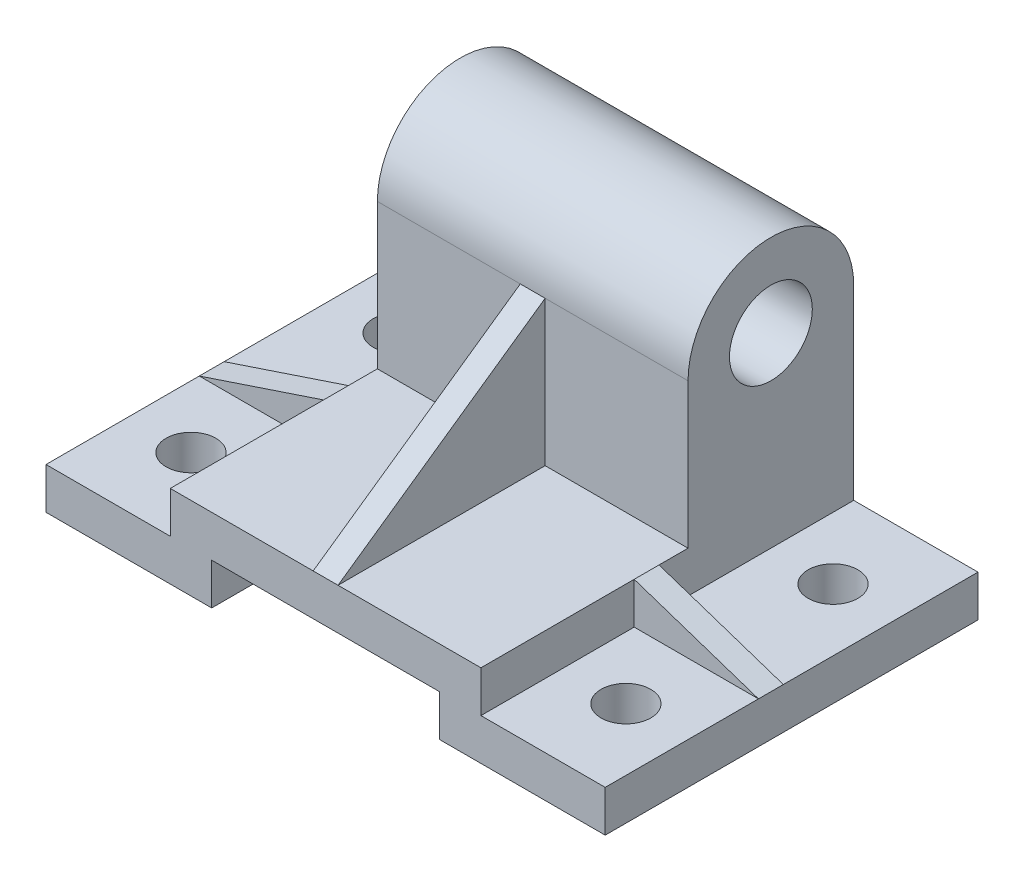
ISO-10303-21;
HEADER;
FILE_DESCRIPTION(('STEP AP214'),'2;1');
FILE_NAME('part.step','',(''),(''),'','','');
FILE_SCHEMA(('AUTOMOTIVE_DESIGN { 1 0 10303 214 1 1 1 1 }'));
ENDSEC;
DATA;
#1=APPLICATION_CONTEXT('core data for automotive mechanical design processes');
#2=APPLICATION_PROTOCOL_DEFINITION('international standard','automotive_design',2000,#1);
#3=PRODUCT_CONTEXT('',#1,'mechanical');
#4=PRODUCT('Part','Part','',(#3));
#5=PRODUCT_RELATED_PRODUCT_CATEGORY('part','',(#4));
#6=PRODUCT_DEFINITION_FORMATION('','',#4);
#7=PRODUCT_DEFINITION_CONTEXT('part definition',#1,'design');
#8=PRODUCT_DEFINITION('design','',#6,#7);
#9=PRODUCT_DEFINITION_SHAPE('','',#8);
#10=(LENGTH_UNIT() NAMED_UNIT(*) SI_UNIT(.MILLI.,.METRE.));
#11=(NAMED_UNIT(*) PLANE_ANGLE_UNIT() SI_UNIT($,.RADIAN.));
#12=(NAMED_UNIT(*) SI_UNIT($,.STERADIAN.) SOLID_ANGLE_UNIT());
#13=UNCERTAINTY_MEASURE_WITH_UNIT(LENGTH_MEASURE(1.E-05),#10,'distance_accuracy_value','');
#14=(GEOMETRIC_REPRESENTATION_CONTEXT(3) GLOBAL_UNCERTAINTY_ASSIGNED_CONTEXT((#13)) GLOBAL_UNIT_ASSIGNED_CONTEXT((#10,
#11,#12)) REPRESENTATION_CONTEXT('',''));
#15=CARTESIAN_POINT('',(0.,0.,0.));
#16=DIRECTION('',(0.,0.,1.));
#17=DIRECTION('',(1.,0.,0.));
#18=AXIS2_PLACEMENT_3D('',#15,#16,#17);
#19=CARTESIAN_POINT('',(105.,20.,-90.));
#20=DIRECTION('',(0.,1.,0.));
#21=DIRECTION('',(-1.,0.,0.));
#22=AXIS2_PLACEMENT_3D('',#19,#20,#21);
#23=PLANE('',#22);
#24=DIRECTION('',(1.,0.,0.));
#25=VECTOR('',#24,1.);
#26=CARTESIAN_POINT('',(105.,20.,-50.));
#27=LINE('',#26,#25);
#28=CARTESIAN_POINT('',(70.5,20.,-50.));
#29=VERTEX_POINT('',#28);
#30=CARTESIAN_POINT('',(105.,20.,-50.));
#31=VERTEX_POINT('',#30);
#32=EDGE_CURVE('E218',#29,#31,#27,.T.);
#33=ORIENTED_EDGE('',*,*,#32,.F.);
#34=DIRECTION('',(0.,0.,1.));
#35=VECTOR('',#34,1.);
#36=CARTESIAN_POINT('',(70.5,20.,-50.));
#37=LINE('',#36,#35);
#38=CARTESIAN_POINT('',(70.5,20.,0.));
#39=VERTEX_POINT('',#38);
#40=EDGE_CURVE('E50',#29,#39,#37,.T.);
#41=ORIENTED_EDGE('',*,*,#40,.T.);
#42=DIRECTION('',(-1.,0.,0.));
#43=VECTOR('',#42,1.);
#44=CARTESIAN_POINT('',(105.,20.,0.));
#45=LINE('',#44,#43);
#46=CARTESIAN_POINT('',(105.,20.,0.));
#47=VERTEX_POINT('',#46);
#48=EDGE_CURVE('E306',#47,#39,#45,.T.);
#49=ORIENTED_EDGE('',*,*,#48,.F.);
#50=DIRECTION('',(0.,0.,1.));
#51=VECTOR('',#50,1.);
#52=CARTESIAN_POINT('',(105.,20.,-90.));
#53=LINE('',#52,#51);
#54=CARTESIAN_POINT('',(105.,20.,-37.));
#55=VERTEX_POINT('',#54);
#56=EDGE_CURVE('E330',#55,#47,#53,.T.);
#57=ORIENTED_EDGE('',*,*,#56,.F.);
#58=DIRECTION('',(0.,0.,1.));
#59=VECTOR('',#58,1.);
#60=CARTESIAN_POINT('',(105.,20.,-43.));
#61=LINE('',#60,#59);
#62=CARTESIAN_POINT('',(105.,20.,-43.));
#63=VERTEX_POINT('',#62);
#64=EDGE_CURVE('E418',#63,#55,#61,.T.);
#65=ORIENTED_EDGE('',*,*,#64,.F.);
#66=EDGE_CURVE('E327',#31,#63,#53,.T.);
#67=ORIENTED_EDGE('',*,*,#66,.F.);
#68=EDGE_LOOP('',(#33,#41,#49,#57,#65,#67));
#69=FACE_BOUND('',#68,.T.);
#70=ADVANCED_FACE('F33',(#69),#23,.T.);
#71=CARTESIAN_POINT('',(105.,55.,-50.));
#72=DIRECTION('',(0.,0.,1.));
#73=DIRECTION('',(0.,-1.,0.));
#74=AXIS2_PLACEMENT_3D('',#71,#72,#73);
#75=PLANE('',#74);
#76=DIRECTION('',(-1.,0.,0.));
#77=VECTOR('',#76,1.);
#78=CARTESIAN_POINT('',(105.,55.,-50.));
#79=LINE('',#78,#77);
#80=CARTESIAN_POINT('',(105.,55.,-50.));
#81=VERTEX_POINT('',#80);
#82=CARTESIAN_POINT('',(70.5,55.,-50.));
#83=VERTEX_POINT('',#82);
#84=EDGE_CURVE('E226',#81,#83,#79,.T.);
#85=ORIENTED_EDGE('',*,*,#84,.T.);
#86=DIRECTION('',(0.,-1.,0.));
#87=VECTOR('',#86,1.);
#88=CARTESIAN_POINT('',(70.5,55.,-50.));
#89=LINE('',#88,#87);
#90=EDGE_CURVE('E656',#83,#29,#89,.T.);
#91=ORIENTED_EDGE('',*,*,#90,.T.);
#92=ORIENTED_EDGE('',*,*,#32,.T.);
#93=DIRECTION('',(0.,1.,0.));
#94=VECTOR('',#93,1.);
#95=CARTESIAN_POINT('',(105.,55.,-50.));
#96=LINE('',#95,#94);
#97=EDGE_CURVE('E445',#31,#81,#96,.T.);
#98=ORIENTED_EDGE('',*,*,#97,.T.);
#99=EDGE_LOOP('',(#85,#91,#92,#98));
#100=FACE_BOUND('',#99,.T.);
#101=ADVANCED_FACE('F474',(#100),#75,.T.);
#102=CARTESIAN_POINT('',(105.,10.,-90.));
#103=DIRECTION('',(1.,0.,0.));
#104=DIRECTION('',(0.,0.,-1.));
#105=AXIS2_PLACEMENT_3D('',#102,#103,#104);
#106=PLANE('',#105);
#107=DIRECTION('',(0.,0.,1.));
#108=VECTOR('',#107,1.);
#109=CARTESIAN_POINT('',(105.,10.,-90.));
#110=LINE('',#109,#108);
#111=CARTESIAN_POINT('',(105.,10.,-37.));
#112=VERTEX_POINT('',#111);
#113=CARTESIAN_POINT('',(105.,10.,0.));
#114=VERTEX_POINT('',#113);
#115=EDGE_CURVE('E334',#112,#114,#110,.T.);
#116=ORIENTED_EDGE('',*,*,#115,.F.);
#117=DIRECTION('',(0.,-1.,0.));
#118=VECTOR('',#117,1.);
#119=CARTESIAN_POINT('',(105.,10.,-37.));
#120=LINE('',#119,#118);
#121=EDGE_CURVE('E393',#55,#112,#120,.T.);
#122=ORIENTED_EDGE('',*,*,#121,.F.);
#123=ORIENTED_EDGE('',*,*,#56,.T.);
#124=DIRECTION('',(0.,1.,0.));
#125=VECTOR('',#124,1.);
#126=CARTESIAN_POINT('',(105.,10.,0.));
#127=LINE('',#126,#125);
#128=EDGE_CURVE('E303',#114,#47,#127,.T.);
#129=ORIENTED_EDGE('',*,*,#128,.F.);
#130=EDGE_LOOP('',(#116,#122,#123,#129));
#131=FACE_BOUND('',#130,.T.);
#132=ADVANCED_FACE('F390',(#131),#106,.T.);
#133=CARTESIAN_POINT('',(135.,10.,-90.));
#134=DIRECTION('',(0.,1.,0.));
#135=DIRECTION('',(0.,0.,1.));
#136=AXIS2_PLACEMENT_3D('',#133,#134,#135);
#137=PLANE('',#136);
#138=CARTESIAN_POINT('',(120.,10.,-20.));
#139=DIRECTION('',(0.,1.,0.));
#140=DIRECTION('',(0.,0.,-1.));
#141=AXIS2_PLACEMENT_3D('',#138,#139,#140);
#142=CIRCLE('',#141,5.99999999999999);
#143=CARTESIAN_POINT('',(120.,10.,-26.));
#144=VERTEX_POINT('',#143);
#145=EDGE_CURVE('E234',#144,#144,#142,.T.);
#146=ORIENTED_EDGE('',*,*,#145,.F.);
#147=EDGE_LOOP('',(#146));
#148=FACE_BOUND('',#147,.T.);
#149=DIRECTION('',(0.,0.,1.));
#150=VECTOR('',#149,1.);
#151=CARTESIAN_POINT('',(135.,10.,-90.));
#152=LINE('',#151,#150);
#153=CARTESIAN_POINT('',(135.,10.,-37.));
#154=VERTEX_POINT('',#153);
#155=CARTESIAN_POINT('',(135.,10.,0.));
#156=VERTEX_POINT('',#155);
#157=EDGE_CURVE('E338',#154,#156,#152,.T.);
#158=ORIENTED_EDGE('',*,*,#157,.F.);
#159=DIRECTION('',(1.,0.,0.));
#160=VECTOR('',#159,1.);
#161=CARTESIAN_POINT('',(135.,10.,-37.));
#162=LINE('',#161,#160);
#163=EDGE_CURVE('E58',#112,#154,#162,.T.);
#164=ORIENTED_EDGE('',*,*,#163,.F.);
#165=ORIENTED_EDGE('',*,*,#115,.T.);
#166=DIRECTION('',(-1.,0.,0.));
#167=VECTOR('',#166,1.);
#168=CARTESIAN_POINT('',(135.,10.,0.));
#169=LINE('',#168,#167);
#170=EDGE_CURVE('E300',#156,#114,#169,.T.);
#171=ORIENTED_EDGE('',*,*,#170,.F.);
#172=EDGE_LOOP('',(#158,#164,#165,#171));
#173=FACE_BOUND('',#172,.T.);
#174=ADVANCED_FACE('F386',(#148,#173),#137,.T.);
#175=CARTESIAN_POINT('',(30.,10.,-90.));
#176=DIRECTION('',(0.,1.,0.));
#177=DIRECTION('',(0.,0.,1.));
#178=AXIS2_PLACEMENT_3D('',#175,#176,#177);
#179=PLANE('',#178);
#180=CARTESIAN_POINT('',(15.,10.,-20.));
#181=DIRECTION('',(0.,1.,0.));
#182=DIRECTION('',(0.,0.,1.));
#183=AXIS2_PLACEMENT_3D('',#180,#181,#182);
#184=CIRCLE('',#183,6.);
#185=CARTESIAN_POINT('',(15.,10.,-14.));
#186=VERTEX_POINT('',#185);
#187=EDGE_CURVE('E240',#186,#186,#184,.T.);
#188=ORIENTED_EDGE('',*,*,#187,.F.);
#189=EDGE_LOOP('',(#188));
#190=FACE_BOUND('',#189,.T.);
#191=DIRECTION('',(0.,0.,1.));
#192=VECTOR('',#191,1.);
#193=CARTESIAN_POINT('',(30.,10.,-90.));
#194=LINE('',#193,#192);
#195=CARTESIAN_POINT('',(30.,10.,-37.));
#196=VERTEX_POINT('',#195);
#197=CARTESIAN_POINT('',(30.,10.,0.));
#198=VERTEX_POINT('',#197);
#199=EDGE_CURVE('E323',#196,#198,#194,.T.);
#200=ORIENTED_EDGE('',*,*,#199,.F.);
#201=DIRECTION('',(1.,0.,0.));
#202=VECTOR('',#201,1.);
#203=CARTESIAN_POINT('',(0.,10.,-37.));
#204=LINE('',#203,#202);
#205=CARTESIAN_POINT('',(0.,10.,-37.));
#206=VERTEX_POINT('',#205);
#207=EDGE_CURVE('E435',#206,#196,#204,.T.);
#208=ORIENTED_EDGE('',*,*,#207,.F.);
#209=DIRECTION('',(0.,0.,1.));
#210=VECTOR('',#209,1.);
#211=CARTESIAN_POINT('',(0.,10.,-90.));
#212=LINE('',#211,#210);
#213=CARTESIAN_POINT('',(0.,10.,0.));
#214=VERTEX_POINT('',#213);
#215=EDGE_CURVE('E319',#206,#214,#212,.T.);
#216=ORIENTED_EDGE('',*,*,#215,.T.);
#217=DIRECTION('',(-1.,0.,0.));
#218=VECTOR('',#217,1.);
#219=CARTESIAN_POINT('',(30.,10.,0.));
#220=LINE('',#219,#218);
#221=EDGE_CURVE('E312',#198,#214,#220,.T.);
#222=ORIENTED_EDGE('',*,*,#221,.F.);
#223=EDGE_LOOP('',(#200,#208,#216,#222));
#224=FACE_BOUND('',#223,.T.);
#225=ADVANCED_FACE('F504',(#190,#224),#179,.T.);
#226=CARTESIAN_POINT('',(30.,20.,-90.));
#227=DIRECTION('',(-1.,0.,0.));
#228=DIRECTION('',(0.,0.,1.));
#229=AXIS2_PLACEMENT_3D('',#226,#227,#228);
#230=PLANE('',#229);
#231=DIRECTION('',(0.,0.,1.));
#232=VECTOR('',#231,1.);
#233=CARTESIAN_POINT('',(30.,20.,-90.));
#234=LINE('',#233,#232);
#235=CARTESIAN_POINT('',(30.,20.,-37.));
#236=VERTEX_POINT('',#235);
#237=CARTESIAN_POINT('',(30.,20.,0.));
#238=VERTEX_POINT('',#237);
#239=EDGE_CURVE('E326',#236,#238,#234,.T.);
#240=ORIENTED_EDGE('',*,*,#239,.F.);
#241=DIRECTION('',(0.,1.,0.));
#242=VECTOR('',#241,1.);
#243=CARTESIAN_POINT('',(30.,10.,-37.));
#244=LINE('',#243,#242);
#245=EDGE_CURVE('E426',#196,#236,#244,.T.);
#246=ORIENTED_EDGE('',*,*,#245,.F.);
#247=ORIENTED_EDGE('',*,*,#199,.T.);
#248=DIRECTION('',(0.,-1.,0.));
#249=VECTOR('',#248,1.);
#250=CARTESIAN_POINT('',(30.,20.,0.));
#251=LINE('',#250,#249);
#252=EDGE_CURVE('E309',#238,#198,#251,.T.);
#253=ORIENTED_EDGE('',*,*,#252,.F.);
#254=EDGE_LOOP('',(#240,#246,#247,#253));
#255=FACE_BOUND('',#254,.T.);
#256=ADVANCED_FACE('F497',(#255),#230,.T.);
#257=CARTESIAN_POINT('',(0.,0.,-90.));
#258=DIRECTION('',(0.,-1.,0.));
#259=DIRECTION('',(0.,0.,-1.));
#260=AXIS2_PLACEMENT_3D('',#257,#258,#259);
#261=PLANE('',#260);
#262=CARTESIAN_POINT('',(15.,0.,-70.));
#263=DIRECTION('',(0.,1.,0.));
#264=DIRECTION('',(0.,0.,-1.));
#265=AXIS2_PLACEMENT_3D('',#262,#263,#264);
#266=CIRCLE('',#265,6.);
#267=CARTESIAN_POINT('',(15.,0.,-76.));
#268=VERTEX_POINT('',#267);
#269=EDGE_CURVE('E231',#268,#268,#266,.T.);
#270=ORIENTED_EDGE('',*,*,#269,.T.);
#271=EDGE_LOOP('',(#270));
#272=FACE_BOUND('',#271,.T.);
#273=CARTESIAN_POINT('',(15.,0.,-20.));
#274=DIRECTION('',(0.,1.,0.));
#275=DIRECTION('',(0.,0.,1.));
#276=AXIS2_PLACEMENT_3D('',#273,#274,#275);
#277=CIRCLE('',#276,6.);
#278=CARTESIAN_POINT('',(15.,0.,-14.));
#279=VERTEX_POINT('',#278);
#280=EDGE_CURVE('E243',#279,#279,#277,.T.);
#281=ORIENTED_EDGE('',*,*,#280,.T.);
#282=EDGE_LOOP('',(#281));
#283=FACE_BOUND('',#282,.T.);
#284=DIRECTION('',(1.,0.,0.));
#285=VECTOR('',#284,1.);
#286=CARTESIAN_POINT('',(0.,0.,0.));
#287=LINE('',#286,#285);
#288=CARTESIAN_POINT('',(0.,0.,0.));
#289=VERTEX_POINT('',#288);
#290=CARTESIAN_POINT('',(40.,0.,0.));
#291=VERTEX_POINT('',#290);
#292=EDGE_CURVE('E246',#289,#291,#287,.T.);
#293=ORIENTED_EDGE('',*,*,#292,.F.);
#294=DIRECTION('',(0.,0.,1.));
#295=VECTOR('',#294,1.);
#296=CARTESIAN_POINT('',(0.,0.,-90.));
#297=LINE('',#296,#295);
#298=CARTESIAN_POINT('',(0.,0.,-90.));
#299=VERTEX_POINT('',#298);
#300=EDGE_CURVE('E11',#299,#289,#297,.T.);
#301=ORIENTED_EDGE('',*,*,#300,.F.);
#302=DIRECTION('',(1.,0.,0.));
#303=VECTOR('',#302,1.);
#304=CARTESIAN_POINT('',(0.,0.,-90.));
#305=LINE('',#304,#303);
#306=CARTESIAN_POINT('',(40.,0.,-90.));
#307=VERTEX_POINT('',#306);
#308=EDGE_CURVE('E249',#299,#307,#305,.T.);
#309=ORIENTED_EDGE('',*,*,#308,.T.);
#310=DIRECTION('',(0.,0.,1.));
#311=VECTOR('',#310,1.);
#312=CARTESIAN_POINT('',(40.,0.,-90.));
#313=LINE('',#312,#311);
#314=EDGE_CURVE('E282',#307,#291,#313,.T.);
#315=ORIENTED_EDGE('',*,*,#314,.T.);
#316=EDGE_LOOP('',(#293,#301,#309,#315));
#317=FACE_BOUND('',#316,.T.);
#318=ADVANCED_FACE('F35',(#272,#283,#317),#261,.T.);
#319=CARTESIAN_POINT('',(0.,0.,-90.));
#320=DIRECTION('',(-1.,0.,0.));
#321=DIRECTION('',(0.,0.,1.));
#322=AXIS2_PLACEMENT_3D('',#319,#320,#321);
#323=PLANE('',#322);
#324=DIRECTION('',(0.,-1.,0.));
#325=VECTOR('',#324,1.);
#326=CARTESIAN_POINT('',(0.,0.,0.));
#327=LINE('',#326,#325);
#328=EDGE_CURVE('E253',#214,#289,#327,.T.);
#329=ORIENTED_EDGE('',*,*,#328,.F.);
#330=ORIENTED_EDGE('',*,*,#215,.F.);
#331=DIRECTION('',(0.,0.,1.));
#332=VECTOR('',#331,1.);
#333=CARTESIAN_POINT('',(0.,10.,-43.));
#334=LINE('',#333,#332);
#335=CARTESIAN_POINT('',(0.,10.,-43.));
#336=VERTEX_POINT('',#335);
#337=EDGE_CURVE('E432',#336,#206,#334,.T.);
#338=ORIENTED_EDGE('',*,*,#337,.F.);
#339=CARTESIAN_POINT('',(0.,10.,-90.));
#340=VERTEX_POINT('',#339);
#341=EDGE_CURVE('E42',#340,#336,#212,.T.);
#342=ORIENTED_EDGE('',*,*,#341,.F.);
#343=DIRECTION('',(0.,-1.,0.));
#344=VECTOR('',#343,1.);
#345=CARTESIAN_POINT('',(0.,0.,-90.));
#346=LINE('',#345,#344);
#347=EDGE_CURVE('E279',#340,#299,#346,.T.);
#348=ORIENTED_EDGE('',*,*,#347,.T.);
#349=ORIENTED_EDGE('',*,*,#300,.T.);
#350=EDGE_LOOP('',(#329,#330,#338,#342,#348,#349));
#351=FACE_BOUND('',#350,.T.);
#352=ADVANCED_FACE('F360',(#351),#323,.T.);
#353=DIRECTION('',(1.,0.,0.));
#354=VECTOR('',#353,1.);
#355=CARTESIAN_POINT('',(0.,10.,-43.));
#356=LINE('',#355,#354);
#357=CARTESIAN_POINT('',(30.,10.,-43.));
#358=VERTEX_POINT('',#357);
#359=EDGE_CURVE('E425',#336,#358,#356,.T.);
#360=ORIENTED_EDGE('',*,*,#359,.T.);
#361=CARTESIAN_POINT('',(30.,10.,-90.));
#362=VERTEX_POINT('',#361);
#363=EDGE_CURVE('E320',#362,#358,#194,.T.);
#364=ORIENTED_EDGE('',*,*,#363,.F.);
#365=DIRECTION('',(-1.,0.,0.));
#366=VECTOR('',#365,1.);
#367=CARTESIAN_POINT('',(30.,10.,-90.));
#368=LINE('',#367,#366);
#369=EDGE_CURVE('E276',#362,#340,#368,.T.);
#370=ORIENTED_EDGE('',*,*,#369,.T.);
#371=ORIENTED_EDGE('',*,*,#341,.T.);
#372=EDGE_LOOP('',(#360,#364,#370,#371));
#373=FACE_BOUND('',#372,.T.);
#374=CARTESIAN_POINT('',(15.,10.,-70.));
#375=DIRECTION('',(0.,1.,0.));
#376=DIRECTION('',(0.,0.,-1.));
#377=AXIS2_PLACEMENT_3D('',#374,#375,#376);
#378=CIRCLE('',#377,6.);
#379=CARTESIAN_POINT('',(15.,10.,-76.));
#380=VERTEX_POINT('',#379);
#381=EDGE_CURVE('E229',#380,#380,#378,.T.);
#382=ORIENTED_EDGE('',*,*,#381,.F.);
#383=EDGE_LOOP('',(#382));
#384=FACE_BOUND('',#383,.T.);
#385=ADVANCED_FACE('F496',(#373,#384),#179,.T.);
#386=DIRECTION('',(0.,1.,0.));
#387=VECTOR('',#386,1.);
#388=CARTESIAN_POINT('',(30.,10.,-43.));
#389=LINE('',#388,#387);
#390=CARTESIAN_POINT('',(30.,20.,-43.));
#391=VERTEX_POINT('',#390);
#392=EDGE_CURVE('E429',#358,#391,#389,.T.);
#393=ORIENTED_EDGE('',*,*,#392,.T.);
#394=CARTESIAN_POINT('',(30.,20.,-50.));
#395=VERTEX_POINT('',#394);
#396=EDGE_CURVE('E324',#395,#391,#234,.T.);
#397=ORIENTED_EDGE('',*,*,#396,.F.);
#398=DIRECTION('',(0.,1.,0.));
#399=VECTOR('',#398,1.);
#400=CARTESIAN_POINT('',(30.,55.,-50.));
#401=LINE('',#400,#399);
#402=CARTESIAN_POINT('',(30.,55.,-50.));
#403=VERTEX_POINT('',#402);
#404=EDGE_CURVE('E216',#395,#403,#401,.T.);
#405=ORIENTED_EDGE('',*,*,#404,.T.);
#406=CARTESIAN_POINT('',(30.,55.,-70.));
#407=DIRECTION('',(-1.,0.,0.));
#408=DIRECTION('',(0.,0.,1.));
#409=AXIS2_PLACEMENT_3D('',#406,#407,#408);
#410=CIRCLE('',#409,20.);
#411=CARTESIAN_POINT('',(30.,55.,-90.));
#412=VERTEX_POINT('',#411);
#413=EDGE_CURVE('E448',#403,#412,#410,.T.);
#414=ORIENTED_EDGE('',*,*,#413,.T.);
#415=DIRECTION('',(0.,-1.,0.));
#416=VECTOR('',#415,1.);
#417=CARTESIAN_POINT('',(30.,20.,-90.));
#418=LINE('',#417,#416);
#419=EDGE_CURVE('E273',#412,#362,#418,.T.);
#420=ORIENTED_EDGE('',*,*,#419,.T.);
#421=ORIENTED_EDGE('',*,*,#363,.T.);
#422=EDGE_LOOP('',(#393,#397,#405,#414,#420,#421));
#423=FACE_BOUND('',#422,.T.);
#424=CARTESIAN_POINT('',(30.,55.,-70.));
#425=DIRECTION('',(-1.,0.,0.));
#426=DIRECTION('',(0.,0.,1.));
#427=AXIS2_PLACEMENT_3D('',#424,#425,#426);
#428=CIRCLE('',#427,10.);
#429=CARTESIAN_POINT('',(30.,55.,-60.));
#430=VERTEX_POINT('',#429);
#431=EDGE_CURVE('E441',#430,#430,#428,.T.);
#432=ORIENTED_EDGE('',*,*,#431,.F.);
#433=EDGE_LOOP('',(#432));
#434=FACE_BOUND('',#433,.T.);
#435=ADVANCED_FACE('F462',(#423,#434),#230,.T.);
#436=DIRECTION('',(0.,0.,1.));
#437=VECTOR('',#436,1.);
#438=CARTESIAN_POINT('',(64.5,20.,-50.));
#439=LINE('',#438,#437);
#440=CARTESIAN_POINT('',(64.5,20.,-50.));
#441=VERTEX_POINT('',#440);
#442=CARTESIAN_POINT('',(64.5,20.,0.));
#443=VERTEX_POINT('',#442);
#444=EDGE_CURVE('E194',#441,#443,#439,.T.);
#445=ORIENTED_EDGE('',*,*,#444,.F.);
#446=EDGE_CURVE('E208',#395,#441,#27,.T.);
#447=ORIENTED_EDGE('',*,*,#446,.F.);
#448=ORIENTED_EDGE('',*,*,#396,.T.);
#449=DIRECTION('',(0.,0.,1.));
#450=VECTOR('',#449,1.);
#451=CARTESIAN_POINT('',(30.,20.,-43.));
#452=LINE('',#451,#450);
#453=EDGE_CURVE('E438',#391,#236,#452,.T.);
#454=ORIENTED_EDGE('',*,*,#453,.T.);
#455=ORIENTED_EDGE('',*,*,#239,.T.);
#456=EDGE_CURVE('E211',#443,#238,#45,.T.);
#457=ORIENTED_EDGE('',*,*,#456,.F.);
#458=EDGE_LOOP('',(#445,#447,#448,#454,#455,#457));
#459=FACE_BOUND('',#458,.T.);
#460=ADVANCED_FACE('F206',(#459),#23,.T.);
#461=DIRECTION('',(0.,-1.,0.));
#462=VECTOR('',#461,1.);
#463=CARTESIAN_POINT('',(105.,10.,-43.));
#464=LINE('',#463,#462);
#465=CARTESIAN_POINT('',(105.,10.,-43.));
#466=VERTEX_POINT('',#465);
#467=EDGE_CURVE('E412',#63,#466,#464,.T.);
#468=ORIENTED_EDGE('',*,*,#467,.T.);
#469=CARTESIAN_POINT('',(105.,10.,-90.));
#470=VERTEX_POINT('',#469);
#471=EDGE_CURVE('E331',#470,#466,#110,.T.);
#472=ORIENTED_EDGE('',*,*,#471,.F.);
#473=DIRECTION('',(0.,1.,0.));
#474=VECTOR('',#473,1.);
#475=CARTESIAN_POINT('',(105.,10.,-90.));
#476=LINE('',#475,#474);
#477=CARTESIAN_POINT('',(105.,55.,-90.));
#478=VERTEX_POINT('',#477);
#479=EDGE_CURVE('E271',#470,#478,#476,.T.);
#480=ORIENTED_EDGE('',*,*,#479,.T.);
#481=CARTESIAN_POINT('',(105.,55.,-70.));
#482=DIRECTION('',(-1.,0.,0.));
#483=DIRECTION('',(0.,0.,1.));
#484=AXIS2_PLACEMENT_3D('',#481,#482,#483);
#485=CIRCLE('',#484,20.);
#486=EDGE_CURVE('E447',#81,#478,#485,.T.);
#487=ORIENTED_EDGE('',*,*,#486,.F.);
#488=ORIENTED_EDGE('',*,*,#97,.F.);
#489=ORIENTED_EDGE('',*,*,#66,.T.);
#490=EDGE_LOOP('',(#468,#472,#480,#487,#488,#489));
#491=FACE_BOUND('',#490,.T.);
#492=CARTESIAN_POINT('',(105.,55.,-70.));
#493=DIRECTION('',(1.,0.,0.));
#494=DIRECTION('',(0.,0.,-1.));
#495=AXIS2_PLACEMENT_3D('',#492,#493,#494);
#496=CIRCLE('',#495,10.);
#497=CARTESIAN_POINT('',(105.,55.,-80.));
#498=VERTEX_POINT('',#497);
#499=EDGE_CURVE('E37',#498,#498,#496,.T.);
#500=ORIENTED_EDGE('',*,*,#499,.F.);
#501=EDGE_LOOP('',(#500));
#502=FACE_BOUND('',#501,.T.);
#503=ADVANCED_FACE('F489',(#491,#502),#106,.T.);
#504=DIRECTION('',(1.,0.,0.));
#505=VECTOR('',#504,1.);
#506=CARTESIAN_POINT('',(135.,10.,-43.));
#507=LINE('',#506,#505);
#508=CARTESIAN_POINT('',(135.,10.,-43.));
#509=VERTEX_POINT('',#508);
#510=EDGE_CURVE('E407',#466,#509,#507,.T.);
#511=ORIENTED_EDGE('',*,*,#510,.T.);
#512=CARTESIAN_POINT('',(135.,10.,-90.));
#513=VERTEX_POINT('',#512);
#514=EDGE_CURVE('E335',#513,#509,#152,.T.);
#515=ORIENTED_EDGE('',*,*,#514,.F.);
#516=DIRECTION('',(-1.,0.,0.));
#517=VECTOR('',#516,1.);
#518=CARTESIAN_POINT('',(135.,10.,-90.));
#519=LINE('',#518,#517);
#520=EDGE_CURVE('E268',#513,#470,#519,.T.);
#521=ORIENTED_EDGE('',*,*,#520,.T.);
#522=ORIENTED_EDGE('',*,*,#471,.T.);
#523=EDGE_LOOP('',(#511,#515,#521,#522));
#524=FACE_BOUND('',#523,.T.);
#525=CARTESIAN_POINT('',(120.,10.,-70.));
#526=DIRECTION('',(0.,1.,0.));
#527=DIRECTION('',(0.,0.,1.));
#528=AXIS2_PLACEMENT_3D('',#525,#526,#527);
#529=CIRCLE('',#528,5.99999999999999);
#530=CARTESIAN_POINT('',(120.,10.,-64.));
#531=VERTEX_POINT('',#530);
#532=EDGE_CURVE('E217',#531,#531,#529,.T.);
#533=ORIENTED_EDGE('',*,*,#532,.F.);
#534=EDGE_LOOP('',(#533));
#535=FACE_BOUND('',#534,.T.);
#536=ADVANCED_FACE('F493',(#524,#535),#137,.T.);
#537=CARTESIAN_POINT('',(135.,0.,-90.));
#538=DIRECTION('',(1.,0.,0.));
#539=DIRECTION('',(0.,0.,-1.));
#540=AXIS2_PLACEMENT_3D('',#537,#538,#539);
#541=PLANE('',#540);
#542=DIRECTION('',(0.,1.,0.));
#543=VECTOR('',#542,1.);
#544=CARTESIAN_POINT('',(135.,0.,0.));
#545=LINE('',#544,#543);
#546=CARTESIAN_POINT('',(135.,0.,0.));
#547=VERTEX_POINT('',#546);
#548=EDGE_CURVE('E297',#547,#156,#545,.T.);
#549=ORIENTED_EDGE('',*,*,#548,.F.);
#550=DIRECTION('',(0.,0.,1.));
#551=VECTOR('',#550,1.);
#552=CARTESIAN_POINT('',(135.,0.,-90.));
#553=LINE('',#552,#551);
#554=CARTESIAN_POINT('',(135.,0.,-90.));
#555=VERTEX_POINT('',#554);
#556=EDGE_CURVE('E339',#555,#547,#553,.T.);
#557=ORIENTED_EDGE('',*,*,#556,.F.);
#558=DIRECTION('',(0.,1.,0.));
#559=VECTOR('',#558,1.);
#560=CARTESIAN_POINT('',(135.,0.,-90.));
#561=LINE('',#560,#559);
#562=EDGE_CURVE('E265',#555,#513,#561,.T.);
#563=ORIENTED_EDGE('',*,*,#562,.T.);
#564=ORIENTED_EDGE('',*,*,#514,.T.);
#565=DIRECTION('',(0.,0.,1.));
#566=VECTOR('',#565,1.);
#567=CARTESIAN_POINT('',(135.,10.,-43.));
#568=LINE('',#567,#566);
#569=EDGE_CURVE('E414',#509,#154,#568,.T.);
#570=ORIENTED_EDGE('',*,*,#569,.T.);
#571=ORIENTED_EDGE('',*,*,#157,.T.);
#572=EDGE_LOOP('',(#549,#557,#563,#564,#570,#571));
#573=FACE_BOUND('',#572,.T.);
#574=ADVANCED_FACE('F380',(#573),#541,.T.);
#575=CARTESIAN_POINT('',(95.,0.,-90.));
#576=DIRECTION('',(0.,-1.,0.));
#577=DIRECTION('',(0.,0.,-1.));
#578=AXIS2_PLACEMENT_3D('',#575,#576,#577);
#579=PLANE('',#578);
#580=CARTESIAN_POINT('',(120.,0.,-70.));
#581=DIRECTION('',(0.,1.,0.));
#582=DIRECTION('',(0.,0.,1.));
#583=AXIS2_PLACEMENT_3D('',#580,#581,#582);
#584=CIRCLE('',#583,5.99999999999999);
#585=CARTESIAN_POINT('',(120.,0.,-64.));
#586=VERTEX_POINT('',#585);
#587=EDGE_CURVE('E221',#586,#586,#584,.T.);
#588=ORIENTED_EDGE('',*,*,#587,.T.);
#589=EDGE_LOOP('',(#588));
#590=FACE_BOUND('',#589,.T.);
#591=CARTESIAN_POINT('',(120.,0.,-20.));
#592=DIRECTION('',(0.,1.,0.));
#593=DIRECTION('',(0.,0.,-1.));
#594=AXIS2_PLACEMENT_3D('',#591,#592,#593);
#595=CIRCLE('',#594,5.99999999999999);
#596=CARTESIAN_POINT('',(120.,0.,-26.));
#597=VERTEX_POINT('',#596);
#598=EDGE_CURVE('E237',#597,#597,#595,.T.);
#599=ORIENTED_EDGE('',*,*,#598,.T.);
#600=EDGE_LOOP('',(#599));
#601=FACE_BOUND('',#600,.T.);
#602=DIRECTION('',(1.,0.,0.));
#603=VECTOR('',#602,1.);
#604=CARTESIAN_POINT('',(95.,0.,0.));
#605=LINE('',#604,#603);
#606=CARTESIAN_POINT('',(95.,0.,0.));
#607=VERTEX_POINT('',#606);
#608=EDGE_CURVE('E294',#607,#547,#605,.T.);
#609=ORIENTED_EDGE('',*,*,#608,.F.);
#610=DIRECTION('',(0.,0.,1.));
#611=VECTOR('',#610,1.);
#612=CARTESIAN_POINT('',(95.,0.,-90.));
#613=LINE('',#612,#611);
#614=CARTESIAN_POINT('',(95.,0.,-90.));
#615=VERTEX_POINT('',#614);
#616=EDGE_CURVE('E341',#615,#607,#613,.T.);
#617=ORIENTED_EDGE('',*,*,#616,.F.);
#618=DIRECTION('',(1.,0.,0.));
#619=VECTOR('',#618,1.);
#620=CARTESIAN_POINT('',(95.,0.,-90.));
#621=LINE('',#620,#619);
#622=EDGE_CURVE('E262',#615,#555,#621,.T.);
#623=ORIENTED_EDGE('',*,*,#622,.T.);
#624=ORIENTED_EDGE('',*,*,#556,.T.);
#625=EDGE_LOOP('',(#609,#617,#623,#624));
#626=FACE_BOUND('',#625,.T.);
#627=ADVANCED_FACE('F376',(#590,#601,#626),#579,.T.);
#628=CARTESIAN_POINT('',(95.,10.,-90.));
#629=DIRECTION('',(-1.,0.,0.));
#630=DIRECTION('',(0.,0.,1.));
#631=AXIS2_PLACEMENT_3D('',#628,#629,#630);
#632=PLANE('',#631);
#633=DIRECTION('',(0.,-1.,0.));
#634=VECTOR('',#633,1.);
#635=CARTESIAN_POINT('',(95.,10.,0.));
#636=LINE('',#635,#634);
#637=CARTESIAN_POINT('',(95.,10.,0.));
#638=VERTEX_POINT('',#637);
#639=EDGE_CURVE('E291',#638,#607,#636,.T.);
#640=ORIENTED_EDGE('',*,*,#639,.F.);
#641=DIRECTION('',(0.,0.,1.));
#642=VECTOR('',#641,1.);
#643=CARTESIAN_POINT('',(95.,10.,-90.));
#644=LINE('',#643,#642);
#645=CARTESIAN_POINT('',(95.,10.,-90.));
#646=VERTEX_POINT('',#645);
#647=EDGE_CURVE('E343',#646,#638,#644,.T.);
#648=ORIENTED_EDGE('',*,*,#647,.F.);
#649=DIRECTION('',(0.,-1.,0.));
#650=VECTOR('',#649,1.);
#651=CARTESIAN_POINT('',(95.,10.,-90.));
#652=LINE('',#651,#650);
#653=EDGE_CURVE('E259',#646,#615,#652,.T.);
#654=ORIENTED_EDGE('',*,*,#653,.T.);
#655=ORIENTED_EDGE('',*,*,#616,.T.);
#656=EDGE_LOOP('',(#640,#648,#654,#655));
#657=FACE_BOUND('',#656,.T.);
#658=ADVANCED_FACE('F374',(#657),#632,.T.);
#659=CARTESIAN_POINT('',(40.,10.,-90.));
#660=DIRECTION('',(0.,-1.,0.));
#661=DIRECTION('',(0.,0.,-1.));
#662=AXIS2_PLACEMENT_3D('',#659,#660,#661);
#663=PLANE('',#662);
#664=DIRECTION('',(1.,0.,0.));
#665=VECTOR('',#664,1.);
#666=CARTESIAN_POINT('',(40.,10.,0.));
#667=LINE('',#666,#665);
#668=CARTESIAN_POINT('',(40.,10.,0.));
#669=VERTEX_POINT('',#668);
#670=EDGE_CURVE('E288',#669,#638,#667,.T.);
#671=ORIENTED_EDGE('',*,*,#670,.F.);
#672=DIRECTION('',(0.,0.,1.));
#673=VECTOR('',#672,1.);
#674=CARTESIAN_POINT('',(40.,10.,-90.));
#675=LINE('',#674,#673);
#676=CARTESIAN_POINT('',(40.,10.,-90.));
#677=VERTEX_POINT('',#676);
#678=EDGE_CURVE('E345',#677,#669,#675,.T.);
#679=ORIENTED_EDGE('',*,*,#678,.F.);
#680=DIRECTION('',(1.,0.,0.));
#681=VECTOR('',#680,1.);
#682=CARTESIAN_POINT('',(40.,10.,-90.));
#683=LINE('',#682,#681);
#684=EDGE_CURVE('E256',#677,#646,#683,.T.);
#685=ORIENTED_EDGE('',*,*,#684,.T.);
#686=ORIENTED_EDGE('',*,*,#647,.T.);
#687=EDGE_LOOP('',(#671,#679,#685,#686));
#688=FACE_BOUND('',#687,.T.);
#689=ADVANCED_FACE('F370',(#688),#663,.T.);
#690=CARTESIAN_POINT('',(40.,0.,-90.));
#691=DIRECTION('',(1.,0.,0.));
#692=DIRECTION('',(0.,0.,-1.));
#693=AXIS2_PLACEMENT_3D('',#690,#691,#692);
#694=PLANE('',#693);
#695=DIRECTION('',(0.,1.,0.));
#696=VECTOR('',#695,1.);
#697=CARTESIAN_POINT('',(40.,0.,0.));
#698=LINE('',#697,#696);
#699=EDGE_CURVE('E285',#291,#669,#698,.T.);
#700=ORIENTED_EDGE('',*,*,#699,.F.);
#701=ORIENTED_EDGE('',*,*,#314,.F.);
#702=DIRECTION('',(0.,1.,0.));
#703=VECTOR('',#702,1.);
#704=CARTESIAN_POINT('',(40.,0.,-90.));
#705=LINE('',#704,#703);
#706=EDGE_CURVE('E252',#307,#677,#705,.T.);
#707=ORIENTED_EDGE('',*,*,#706,.T.);
#708=ORIENTED_EDGE('',*,*,#678,.T.);
#709=EDGE_LOOP('',(#700,#701,#707,#708));
#710=FACE_BOUND('',#709,.T.);
#711=ADVANCED_FACE('F352',(#710),#694,.T.);
#712=CARTESIAN_POINT('',(0.,0.,-90.));
#713=DIRECTION('',(0.,0.,1.));
#714=DIRECTION('',(1.,0.,0.));
#715=AXIS2_PLACEMENT_3D('',#712,#713,#714);
#716=PLANE('',#715);
#717=ORIENTED_EDGE('',*,*,#653,.F.);
#718=ORIENTED_EDGE('',*,*,#684,.F.);
#719=ORIENTED_EDGE('',*,*,#706,.F.);
#720=ORIENTED_EDGE('',*,*,#308,.F.);
#721=ORIENTED_EDGE('',*,*,#347,.F.);
#722=ORIENTED_EDGE('',*,*,#369,.F.);
#723=ORIENTED_EDGE('',*,*,#419,.F.);
#724=DIRECTION('',(-1.,0.,0.));
#725=VECTOR('',#724,1.);
#726=CARTESIAN_POINT('',(105.,55.,-90.));
#727=LINE('',#726,#725);
#728=EDGE_CURVE('E223',#478,#412,#727,.T.);
#729=ORIENTED_EDGE('',*,*,#728,.F.);
#730=ORIENTED_EDGE('',*,*,#479,.F.);
#731=ORIENTED_EDGE('',*,*,#520,.F.);
#732=ORIENTED_EDGE('',*,*,#562,.F.);
#733=ORIENTED_EDGE('',*,*,#622,.F.);
#734=EDGE_LOOP('',(#717,#718,#719,#720,#721,#722,#723,#729,#730,#731,#732,#733));
#735=FACE_BOUND('',#734,.T.);
#736=ADVANCED_FACE('F365',(#735),#716,.F.);
#737=CARTESIAN_POINT('',(0.,0.,0.));
#738=DIRECTION('',(0.,0.,1.));
#739=DIRECTION('',(1.,0.,0.));
#740=AXIS2_PLACEMENT_3D('',#737,#738,#739);
#741=PLANE('',#740);
#742=ORIENTED_EDGE('',*,*,#292,.T.);
#743=ORIENTED_EDGE('',*,*,#699,.T.);
#744=ORIENTED_EDGE('',*,*,#670,.T.);
#745=ORIENTED_EDGE('',*,*,#639,.T.);
#746=ORIENTED_EDGE('',*,*,#608,.T.);
#747=ORIENTED_EDGE('',*,*,#548,.T.);
#748=ORIENTED_EDGE('',*,*,#170,.T.);
#749=ORIENTED_EDGE('',*,*,#128,.T.);
#750=ORIENTED_EDGE('',*,*,#48,.T.);
#751=DIRECTION('',(1.,0.,0.));
#752=VECTOR('',#751,1.);
#753=CARTESIAN_POINT('',(64.5,20.,0.));
#754=LINE('',#753,#752);
#755=EDGE_CURVE('E397',#443,#39,#754,.T.);
#756=ORIENTED_EDGE('',*,*,#755,.F.);
#757=ORIENTED_EDGE('',*,*,#456,.T.);
#758=ORIENTED_EDGE('',*,*,#252,.T.);
#759=ORIENTED_EDGE('',*,*,#221,.T.);
#760=ORIENTED_EDGE('',*,*,#328,.T.);
#761=EDGE_LOOP('',(#742,#743,#744,#745,#746,#747,#748,#749,#750,#756,#757,#758,#759,#760));
#762=FACE_BOUND('',#761,.T.);
#763=ADVANCED_FACE('F355',(#762),#741,.T.);
#764=CARTESIAN_POINT('',(15.,0.,-20.));
#765=DIRECTION('',(0.,1.,0.));
#766=DIRECTION('',(0.,0.,1.));
#767=AXIS2_PLACEMENT_3D('',#764,#765,#766);
#768=CYLINDRICAL_SURFACE('',#767,6.);
#769=ORIENTED_EDGE('',*,*,#280,.F.);
#770=EDGE_LOOP('',(#769));
#771=FACE_BOUND('',#770,.T.);
#772=ORIENTED_EDGE('',*,*,#187,.T.);
#773=EDGE_LOOP('',(#772));
#774=FACE_BOUND('',#773,.T.);
#775=ADVANCED_FACE('F723',(#771,#774),#768,.F.);
#776=CARTESIAN_POINT('',(120.,0.,-20.));
#777=DIRECTION('',(0.,1.,0.));
#778=DIRECTION('',(0.,0.,1.));
#779=AXIS2_PLACEMENT_3D('',#776,#777,#778);
#780=CYLINDRICAL_SURFACE('',#779,5.99999999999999);
#781=ORIENTED_EDGE('',*,*,#598,.F.);
#782=EDGE_LOOP('',(#781));
#783=FACE_BOUND('',#782,.T.);
#784=ORIENTED_EDGE('',*,*,#145,.T.);
#785=EDGE_LOOP('',(#784));
#786=FACE_BOUND('',#785,.T.);
#787=ADVANCED_FACE('F731',(#783,#786),#780,.F.);
#788=CARTESIAN_POINT('',(15.,0.,-70.));
#789=DIRECTION('',(0.,1.,0.));
#790=DIRECTION('',(0.,0.,1.));
#791=AXIS2_PLACEMENT_3D('',#788,#789,#790);
#792=CYLINDRICAL_SURFACE('',#791,6.);
#793=ORIENTED_EDGE('',*,*,#269,.F.);
#794=EDGE_LOOP('',(#793));
#795=FACE_BOUND('',#794,.T.);
#796=ORIENTED_EDGE('',*,*,#381,.T.);
#797=EDGE_LOOP('',(#796));
#798=FACE_BOUND('',#797,.T.);
#799=ADVANCED_FACE('F476',(#795,#798),#792,.F.);
#800=CARTESIAN_POINT('',(120.,0.,-70.));
#801=DIRECTION('',(0.,1.,0.));
#802=DIRECTION('',(0.,0.,1.));
#803=AXIS2_PLACEMENT_3D('',#800,#801,#802);
#804=CYLINDRICAL_SURFACE('',#803,5.99999999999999);
#805=ORIENTED_EDGE('',*,*,#587,.F.);
#806=EDGE_LOOP('',(#805));
#807=FACE_BOUND('',#806,.T.);
#808=ORIENTED_EDGE('',*,*,#532,.T.);
#809=EDGE_LOOP('',(#808));
#810=FACE_BOUND('',#809,.T.);
#811=ADVANCED_FACE('F466',(#807,#810),#804,.F.);
#812=CARTESIAN_POINT('',(105.,55.,-70.));
#813=DIRECTION('',(-1.,0.,0.));
#814=DIRECTION('',(0.,0.,1.));
#815=AXIS2_PLACEMENT_3D('',#812,#813,#814);
#816=CYLINDRICAL_SURFACE('',#815,20.);
#817=ORIENTED_EDGE('',*,*,#413,.F.);
#818=CARTESIAN_POINT('',(64.5,55.,-50.));
#819=VERTEX_POINT('',#818);
#820=EDGE_CURVE('E451',#819,#403,#79,.T.);
#821=ORIENTED_EDGE('',*,*,#820,.F.);
#822=DIRECTION('',(1.,0.,0.));
#823=VECTOR('',#822,1.);
#824=CARTESIAN_POINT('',(64.5,55.,-50.));
#825=LINE('',#824,#823);
#826=EDGE_CURVE('E399',#819,#83,#825,.T.);
#827=ORIENTED_EDGE('',*,*,#826,.T.);
#828=ORIENTED_EDGE('',*,*,#84,.F.);
#829=ORIENTED_EDGE('',*,*,#486,.T.);
#830=ORIENTED_EDGE('',*,*,#728,.T.);
#831=EDGE_LOOP('',(#817,#821,#827,#828,#829,#830));
#832=FACE_BOUND('',#831,.T.);
#833=ADVANCED_FACE('F464',(#832),#816,.T.);
#834=DIRECTION('',(0.,-1.,0.));
#835=VECTOR('',#834,1.);
#836=CARTESIAN_POINT('',(64.5,55.,-50.));
#837=LINE('',#836,#835);
#838=EDGE_CURVE('E191',#819,#441,#837,.T.);
#839=ORIENTED_EDGE('',*,*,#838,.F.);
#840=ORIENTED_EDGE('',*,*,#820,.T.);
#841=ORIENTED_EDGE('',*,*,#404,.F.);
#842=ORIENTED_EDGE('',*,*,#446,.T.);
#843=EDGE_LOOP('',(#839,#840,#841,#842));
#844=FACE_BOUND('',#843,.T.);
#845=ADVANCED_FACE('F214',(#844),#75,.T.);
#846=CARTESIAN_POINT('',(135.,55.,-70.));
#847=DIRECTION('',(-1.,0.,0.));
#848=DIRECTION('',(0.,0.,1.));
#849=AXIS2_PLACEMENT_3D('',#846,#847,#848);
#850=CYLINDRICAL_SURFACE('',#849,10.);
#851=ORIENTED_EDGE('',*,*,#499,.T.);
#852=EDGE_LOOP('',(#851));
#853=FACE_BOUND('',#852,.T.);
#854=ORIENTED_EDGE('',*,*,#431,.T.);
#855=EDGE_LOOP('',(#854));
#856=FACE_BOUND('',#855,.T.);
#857=ADVANCED_FACE('F472',(#853,#856),#850,.F.);
#858=CARTESIAN_POINT('',(30.,20.,-43.));
#859=DIRECTION('',(-0.316227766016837,0.948683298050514,0.));
#860=DIRECTION('',(-0.948683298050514,-0.316227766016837,0.));
#861=AXIS2_PLACEMENT_3D('',#858,#859,#860);
#862=PLANE('',#861);
#863=DIRECTION('',(-0.948683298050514,-0.316227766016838,0.));
#864=VECTOR('',#863,1.);
#865=CARTESIAN_POINT('',(30.,20.,-37.));
#866=LINE('',#865,#864);
#867=EDGE_CURVE('E420',#236,#206,#866,.T.);
#868=ORIENTED_EDGE('',*,*,#867,.F.);
#869=ORIENTED_EDGE('',*,*,#453,.F.);
#870=DIRECTION('',(-0.948683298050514,-0.316227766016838,0.));
#871=VECTOR('',#870,1.);
#872=CARTESIAN_POINT('',(30.,20.,-43.));
#873=LINE('',#872,#871);
#874=EDGE_CURVE('E422',#391,#336,#873,.T.);
#875=ORIENTED_EDGE('',*,*,#874,.T.);
#876=ORIENTED_EDGE('',*,*,#337,.T.);
#877=EDGE_LOOP('',(#868,#869,#875,#876));
#878=FACE_BOUND('',#877,.T.);
#879=ADVANCED_FACE('F521',(#878),#862,.T.);
#880=CARTESIAN_POINT('',(0.,0.,-43.));
#881=DIRECTION('',(0.,0.,-1.));
#882=DIRECTION('',(-1.,0.,0.));
#883=AXIS2_PLACEMENT_3D('',#880,#881,#882);
#884=PLANE('',#883);
#885=ORIENTED_EDGE('',*,*,#874,.F.);
#886=ORIENTED_EDGE('',*,*,#392,.F.);
#887=ORIENTED_EDGE('',*,*,#359,.F.);
#888=EDGE_LOOP('',(#885,#886,#887));
#889=FACE_BOUND('',#888,.T.);
#890=ADVANCED_FACE('F523',(#889),#884,.T.);
#891=CARTESIAN_POINT('',(0.,0.,-37.));
#892=DIRECTION('',(0.,0.,-1.));
#893=DIRECTION('',(-1.,0.,0.));
#894=AXIS2_PLACEMENT_3D('',#891,#892,#893);
#895=PLANE('',#894);
#896=ORIENTED_EDGE('',*,*,#867,.T.);
#897=ORIENTED_EDGE('',*,*,#207,.T.);
#898=ORIENTED_EDGE('',*,*,#245,.T.);
#899=EDGE_LOOP('',(#896,#897,#898));
#900=FACE_BOUND('',#899,.T.);
#901=ADVANCED_FACE('F552',(#900),#895,.F.);
#902=CARTESIAN_POINT('',(105.,20.,-43.));
#903=DIRECTION('',(0.316227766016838,0.948683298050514,0.));
#904=DIRECTION('',(-0.948683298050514,0.316227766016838,0.));
#905=AXIS2_PLACEMENT_3D('',#902,#903,#904);
#906=PLANE('',#905);
#907=DIRECTION('',(-0.948683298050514,0.316227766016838,0.));
#908=VECTOR('',#907,1.);
#909=CARTESIAN_POINT('',(105.,20.,-37.));
#910=LINE('',#909,#908);
#911=EDGE_CURVE('E401',#154,#55,#910,.T.);
#912=ORIENTED_EDGE('',*,*,#911,.F.);
#913=ORIENTED_EDGE('',*,*,#569,.F.);
#914=DIRECTION('',(-0.948683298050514,0.316227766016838,0.));
#915=VECTOR('',#914,1.);
#916=CARTESIAN_POINT('',(105.,20.,-43.));
#917=LINE('',#916,#915);
#918=EDGE_CURVE('E410',#509,#63,#917,.T.);
#919=ORIENTED_EDGE('',*,*,#918,.T.);
#920=ORIENTED_EDGE('',*,*,#64,.T.);
#921=EDGE_LOOP('',(#912,#913,#919,#920));
#922=FACE_BOUND('',#921,.T.);
#923=ADVANCED_FACE('F535',(#922),#906,.T.);
#924=CARTESIAN_POINT('',(0.,0.,-43.));
#925=DIRECTION('',(0.,0.,-1.));
#926=DIRECTION('',(-1.,0.,0.));
#927=AXIS2_PLACEMENT_3D('',#924,#925,#926);
#928=PLANE('',#927);
#929=ORIENTED_EDGE('',*,*,#510,.F.);
#930=ORIENTED_EDGE('',*,*,#467,.F.);
#931=ORIENTED_EDGE('',*,*,#918,.F.);
#932=EDGE_LOOP('',(#929,#930,#931));
#933=FACE_BOUND('',#932,.T.);
#934=ADVANCED_FACE('F537',(#933),#928,.T.);
#935=CARTESIAN_POINT('',(0.,0.,-37.));
#936=DIRECTION('',(0.,0.,-1.));
#937=DIRECTION('',(-1.,0.,0.));
#938=AXIS2_PLACEMENT_3D('',#935,#936,#937);
#939=PLANE('',#938);
#940=ORIENTED_EDGE('',*,*,#163,.T.);
#941=ORIENTED_EDGE('',*,*,#911,.T.);
#942=ORIENTED_EDGE('',*,*,#121,.T.);
#943=EDGE_LOOP('',(#940,#941,#942));
#944=FACE_BOUND('',#943,.T.);
#945=ADVANCED_FACE('F539',(#944),#939,.F.);
#946=CARTESIAN_POINT('',(64.5,20.,0.));
#947=DIRECTION('',(0.,-0.81923192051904,-0.573462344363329));
#948=DIRECTION('',(0.,0.573462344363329,-0.81923192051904));
#949=AXIS2_PLACEMENT_3D('',#946,#947,#948);
#950=PLANE('',#949);
#951=DIRECTION('',(0.,0.573462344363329,-0.81923192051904));
#952=VECTOR('',#951,1.);
#953=CARTESIAN_POINT('',(70.5,20.,0.));
#954=LINE('',#953,#952);
#955=EDGE_CURVE('E201',#39,#83,#954,.T.);
#956=ORIENTED_EDGE('',*,*,#955,.T.);
#957=ORIENTED_EDGE('',*,*,#826,.F.);
#958=DIRECTION('',(0.,0.573462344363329,-0.81923192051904));
#959=VECTOR('',#958,1.);
#960=CARTESIAN_POINT('',(64.5,20.,0.));
#961=LINE('',#960,#959);
#962=EDGE_CURVE('E196',#443,#819,#961,.T.);
#963=ORIENTED_EDGE('',*,*,#962,.F.);
#964=ORIENTED_EDGE('',*,*,#755,.T.);
#965=EDGE_LOOP('',(#956,#957,#963,#964));
#966=FACE_BOUND('',#965,.T.);
#967=ADVANCED_FACE('F541',(#966),#950,.F.);
#968=CARTESIAN_POINT('',(64.5,0.,0.));
#969=DIRECTION('',(-1.,0.,0.));
#970=DIRECTION('',(0.,0.,1.));
#971=AXIS2_PLACEMENT_3D('',#968,#969,#970);
#972=PLANE('',#971);
#973=ORIENTED_EDGE('',*,*,#838,.T.);
#974=ORIENTED_EDGE('',*,*,#444,.T.);
#975=ORIENTED_EDGE('',*,*,#962,.T.);
#976=EDGE_LOOP('',(#973,#974,#975));
#977=FACE_BOUND('',#976,.T.);
#978=ADVANCED_FACE('F193',(#977),#972,.T.);
#979=CARTESIAN_POINT('',(70.5,0.,0.));
#980=DIRECTION('',(-1.,0.,0.));
#981=DIRECTION('',(0.,0.,1.));
#982=AXIS2_PLACEMENT_3D('',#979,#980,#981);
#983=PLANE('',#982);
#984=ORIENTED_EDGE('',*,*,#90,.F.);
#985=ORIENTED_EDGE('',*,*,#955,.F.);
#986=ORIENTED_EDGE('',*,*,#40,.F.);
#987=EDGE_LOOP('',(#984,#985,#986));
#988=FACE_BOUND('',#987,.T.);
#989=ADVANCED_FACE('F644',(#988),#983,.F.);
#990=CLOSED_SHELL('',(#70,#101,#132,#174,#225,#256,#318,#352,#385,#435,#460,#503,#536,#574,#627,
#658,#689,#711,#736,#763,#775,#787,#799,#811,#833,#845,#857,#879,#890,#901,#923,#934,#945,#967,
#978,#989));
#991=MANIFOLD_SOLID_BREP('B2',#990);
#992=ADVANCED_BREP_SHAPE_REPRESENTATION('',(#18,#991),#14);
#993=SHAPE_DEFINITION_REPRESENTATION(#9,#992);
ENDSEC;
END-ISO-10303-21;
